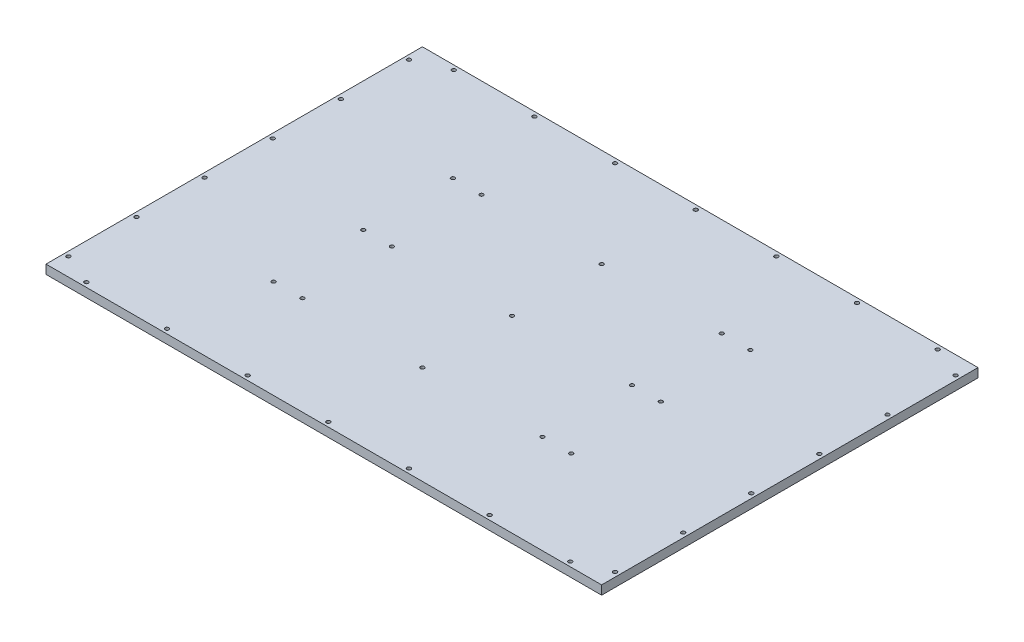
ISO-10303-21;
HEADER;
FILE_DESCRIPTION(('STEP AP214'),'2;1');
FILE_NAME('part.step','',(''),(''),'','','');
FILE_SCHEMA(('AUTOMOTIVE_DESIGN { 1 0 10303 214 1 1 1 1 }'));
ENDSEC;
DATA;
#1=APPLICATION_CONTEXT('core data for automotive mechanical design processes');
#2=APPLICATION_PROTOCOL_DEFINITION('international standard','automotive_design',2000,#1);
#3=PRODUCT_CONTEXT('',#1,'mechanical');
#4=PRODUCT('Part','Part','',(#3));
#5=PRODUCT_RELATED_PRODUCT_CATEGORY('part','',(#4));
#6=PRODUCT_DEFINITION_FORMATION('','',#4);
#7=PRODUCT_DEFINITION_CONTEXT('part definition',#1,'design');
#8=PRODUCT_DEFINITION('design','',#6,#7);
#9=PRODUCT_DEFINITION_SHAPE('','',#8);
#10=(LENGTH_UNIT() NAMED_UNIT(*) SI_UNIT(.MILLI.,.METRE.));
#11=(NAMED_UNIT(*) PLANE_ANGLE_UNIT() SI_UNIT($,.RADIAN.));
#12=(NAMED_UNIT(*) SI_UNIT($,.STERADIAN.) SOLID_ANGLE_UNIT());
#13=UNCERTAINTY_MEASURE_WITH_UNIT(LENGTH_MEASURE(1.E-05),#10,'distance_accuracy_value','');
#14=(GEOMETRIC_REPRESENTATION_CONTEXT(3) GLOBAL_UNCERTAINTY_ASSIGNED_CONTEXT((#13)) GLOBAL_UNIT_ASSIGNED_CONTEXT((#10,
#11,#12)) REPRESENTATION_CONTEXT('',''));
#15=CARTESIAN_POINT('',(0.,0.,0.));
#16=DIRECTION('',(0.,0.,1.));
#17=DIRECTION('',(1.,0.,0.));
#18=AXIS2_PLACEMENT_3D('',#15,#16,#17);
#19=CARTESIAN_POINT('',(0.,10.,0.));
#20=DIRECTION('',(0.,-1.,0.));
#21=DIRECTION('',(0.,0.,-1.));
#22=AXIS2_PLACEMENT_3D('',#19,#20,#21);
#23=PLANE('',#22);
#24=CARTESIAN_POINT('',(166.,10.,-99.9999999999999));
#25=DIRECTION('',(0.,1.,0.));
#26=DIRECTION('',(0.,0.,1.));
#27=AXIS2_PLACEMENT_3D('',#24,#25,#26);
#28=CIRCLE('',#27,2.09999999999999);
#29=CARTESIAN_POINT('',(166.,10.,-97.8999999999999));
#30=VERTEX_POINT('',#29);
#31=EDGE_CURVE('E357',#30,#30,#28,.T.);
#32=ORIENTED_EDGE('',*,*,#31,.F.);
#33=EDGE_LOOP('',(#32));
#34=FACE_BOUND('',#33,.T.);
#35=CARTESIAN_POINT('',(166.,10.,0.));
#36=DIRECTION('',(0.,1.,0.));
#37=DIRECTION('',(0.,0.,1.));
#38=AXIS2_PLACEMENT_3D('',#35,#36,#37);
#39=CIRCLE('',#38,2.09999999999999);
#40=CARTESIAN_POINT('',(166.,10.,2.10000000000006));
#41=VERTEX_POINT('',#40);
#42=EDGE_CURVE('E351',#41,#41,#39,.T.);
#43=ORIENTED_EDGE('',*,*,#42,.F.);
#44=EDGE_LOOP('',(#43));
#45=FACE_BOUND('',#44,.T.);
#46=CARTESIAN_POINT('',(166.,10.,100.));
#47=DIRECTION('',(0.,1.,0.));
#48=DIRECTION('',(0.,0.,1.));
#49=AXIS2_PLACEMENT_3D('',#46,#47,#48);
#50=CIRCLE('',#49,2.09999999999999);
#51=CARTESIAN_POINT('',(166.,10.,102.1));
#52=VERTEX_POINT('',#51);
#53=EDGE_CURVE('E345',#52,#52,#50,.T.);
#54=ORIENTED_EDGE('',*,*,#53,.F.);
#55=EDGE_LOOP('',(#54));
#56=FACE_BOUND('',#55,.T.);
#57=CARTESIAN_POINT('',(134.,10.,100.));
#58=DIRECTION('',(0.,1.,0.));
#59=DIRECTION('',(0.,0.,1.));
#60=AXIS2_PLACEMENT_3D('',#57,#58,#59);
#61=CIRCLE('',#60,2.09999999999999);
#62=CARTESIAN_POINT('',(134.,10.,102.1));
#63=VERTEX_POINT('',#62);
#64=EDGE_CURVE('E339',#63,#63,#61,.T.);
#65=ORIENTED_EDGE('',*,*,#64,.F.);
#66=EDGE_LOOP('',(#65));
#67=FACE_BOUND('',#66,.T.);
#68=CARTESIAN_POINT('',(134.,10.,0.));
#69=DIRECTION('',(0.,1.,0.));
#70=DIRECTION('',(0.,0.,1.));
#71=AXIS2_PLACEMENT_3D('',#68,#69,#70);
#72=CIRCLE('',#71,2.09999999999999);
#73=CARTESIAN_POINT('',(134.,10.,2.10000000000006));
#74=VERTEX_POINT('',#73);
#75=EDGE_CURVE('E333',#74,#74,#72,.T.);
#76=ORIENTED_EDGE('',*,*,#75,.F.);
#77=EDGE_LOOP('',(#76));
#78=FACE_BOUND('',#77,.T.);
#79=CARTESIAN_POINT('',(134.,10.,-99.9999999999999));
#80=DIRECTION('',(0.,1.,0.));
#81=DIRECTION('',(0.,0.,1.));
#82=AXIS2_PLACEMENT_3D('',#79,#80,#81);
#83=CIRCLE('',#82,2.09999999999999);
#84=CARTESIAN_POINT('',(134.,10.,-97.8999999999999));
#85=VERTEX_POINT('',#84);
#86=EDGE_CURVE('E327',#85,#85,#83,.T.);
#87=ORIENTED_EDGE('',*,*,#86,.F.);
#88=EDGE_LOOP('',(#87));
#89=FACE_BOUND('',#88,.T.);
#90=CARTESIAN_POINT('',(0.,10.,0.));
#91=DIRECTION('',(0.,1.,0.));
#92=DIRECTION('',(0.,0.,1.));
#93=AXIS2_PLACEMENT_3D('',#90,#91,#92);
#94=CIRCLE('',#93,2.09999999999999);
#95=CARTESIAN_POINT('',(0.,10.,2.10000000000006));
#96=VERTEX_POINT('',#95);
#97=EDGE_CURVE('E315',#96,#96,#94,.T.);
#98=ORIENTED_EDGE('',*,*,#97,.F.);
#99=EDGE_LOOP('',(#98));
#100=FACE_BOUND('',#99,.T.);
#101=CARTESIAN_POINT('',(0.,10.,100.));
#102=DIRECTION('',(0.,1.,0.));
#103=DIRECTION('',(0.,0.,1.));
#104=AXIS2_PLACEMENT_3D('',#101,#102,#103);
#105=CIRCLE('',#104,2.09999999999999);
#106=CARTESIAN_POINT('',(0.,10.,102.1));
#107=VERTEX_POINT('',#106);
#108=EDGE_CURVE('E309',#107,#107,#105,.T.);
#109=ORIENTED_EDGE('',*,*,#108,.F.);
#110=EDGE_LOOP('',(#109));
#111=FACE_BOUND('',#110,.T.);
#112=CARTESIAN_POINT('',(-134.,10.,0.));
#113=DIRECTION('',(0.,1.,0.));
#114=DIRECTION('',(0.,0.,1.));
#115=AXIS2_PLACEMENT_3D('',#112,#113,#114);
#116=CIRCLE('',#115,2.09999999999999);
#117=CARTESIAN_POINT('',(-134.,10.,2.10000000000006));
#118=VERTEX_POINT('',#117);
#119=EDGE_CURVE('E297',#118,#118,#116,.T.);
#120=ORIENTED_EDGE('',*,*,#119,.F.);
#121=EDGE_LOOP('',(#120));
#122=FACE_BOUND('',#121,.T.);
#123=CARTESIAN_POINT('',(-134.,10.,-99.9999999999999));
#124=DIRECTION('',(0.,1.,0.));
#125=DIRECTION('',(0.,0.,1.));
#126=AXIS2_PLACEMENT_3D('',#123,#124,#125);
#127=CIRCLE('',#126,2.09999999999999);
#128=CARTESIAN_POINT('',(-134.,10.,-97.8999999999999));
#129=VERTEX_POINT('',#128);
#130=EDGE_CURVE('E291',#129,#129,#127,.T.);
#131=ORIENTED_EDGE('',*,*,#130,.F.);
#132=EDGE_LOOP('',(#131));
#133=FACE_BOUND('',#132,.T.);
#134=CARTESIAN_POINT('',(-166.,10.,-99.9999999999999));
#135=DIRECTION('',(0.,1.,0.));
#136=DIRECTION('',(0.,0.,1.));
#137=AXIS2_PLACEMENT_3D('',#134,#135,#136);
#138=CIRCLE('',#137,2.09999999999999);
#139=CARTESIAN_POINT('',(-166.,10.,-97.8999999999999));
#140=VERTEX_POINT('',#139);
#141=EDGE_CURVE('E285',#140,#140,#138,.T.);
#142=ORIENTED_EDGE('',*,*,#141,.F.);
#143=EDGE_LOOP('',(#142));
#144=FACE_BOUND('',#143,.T.);
#145=CARTESIAN_POINT('',(-166.,10.,0.));
#146=DIRECTION('',(0.,1.,0.));
#147=DIRECTION('',(0.,0.,1.));
#148=AXIS2_PLACEMENT_3D('',#145,#146,#147);
#149=CIRCLE('',#148,2.09999999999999);
#150=CARTESIAN_POINT('',(-166.,10.,2.10000000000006));
#151=VERTEX_POINT('',#150);
#152=EDGE_CURVE('E279',#151,#151,#149,.T.);
#153=ORIENTED_EDGE('',*,*,#152,.F.);
#154=EDGE_LOOP('',(#153));
#155=FACE_BOUND('',#154,.T.);
#156=CARTESIAN_POINT('',(-166.,10.,100.));
#157=DIRECTION('',(0.,1.,0.));
#158=DIRECTION('',(0.,0.,1.));
#159=AXIS2_PLACEMENT_3D('',#156,#157,#158);
#160=CIRCLE('',#159,2.09999999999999);
#161=CARTESIAN_POINT('',(-166.,10.,102.1));
#162=VERTEX_POINT('',#161);
#163=EDGE_CURVE('E273',#162,#162,#160,.T.);
#164=ORIENTED_EDGE('',*,*,#163,.F.);
#165=EDGE_LOOP('',(#164));
#166=FACE_BOUND('',#165,.T.);
#167=CARTESIAN_POINT('',(305.,10.,189.999999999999));
#168=DIRECTION('',(0.,-1.,0.));
#169=DIRECTION('',(0.,0.,-1.));
#170=AXIS2_PLACEMENT_3D('',#167,#168,#169);
#171=CIRCLE('',#170,2.14999999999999);
#172=CARTESIAN_POINT('',(305.,10.,187.849999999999));
#173=VERTEX_POINT('',#172);
#174=EDGE_CURVE('E264',#173,#173,#171,.T.);
#175=ORIENTED_EDGE('',*,*,#174,.T.);
#176=EDGE_LOOP('',(#175));
#177=FACE_BOUND('',#176,.T.);
#178=CARTESIAN_POINT('',(305.,10.,113.999999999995));
#179=DIRECTION('',(0.,-1.,0.));
#180=DIRECTION('',(0.,0.,-1.));
#181=AXIS2_PLACEMENT_3D('',#178,#179,#180);
#182=CIRCLE('',#181,2.14999999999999);
#183=CARTESIAN_POINT('',(305.,10.,111.849999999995));
#184=VERTEX_POINT('',#183);
#185=EDGE_CURVE('E258',#184,#184,#182,.T.);
#186=ORIENTED_EDGE('',*,*,#185,.T.);
#187=EDGE_LOOP('',(#186));
#188=FACE_BOUND('',#187,.T.);
#189=CARTESIAN_POINT('',(305.,10.,37.999999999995));
#190=DIRECTION('',(0.,-1.,0.));
#191=DIRECTION('',(0.,0.,-1.));
#192=AXIS2_PLACEMENT_3D('',#189,#190,#191);
#193=CIRCLE('',#192,2.14999999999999);
#194=CARTESIAN_POINT('',(305.,10.,35.8499999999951));
#195=VERTEX_POINT('',#194);
#196=EDGE_CURVE('E252',#195,#195,#193,.T.);
#197=ORIENTED_EDGE('',*,*,#196,.T.);
#198=EDGE_LOOP('',(#197));
#199=FACE_BOUND('',#198,.T.);
#200=CARTESIAN_POINT('',(305.,10.,-38.0000000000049));
#201=DIRECTION('',(0.,-1.,0.));
#202=DIRECTION('',(0.,0.,-1.));
#203=AXIS2_PLACEMENT_3D('',#200,#201,#202);
#204=CIRCLE('',#203,2.14999999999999);
#205=CARTESIAN_POINT('',(305.,10.,-40.1500000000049));
#206=VERTEX_POINT('',#205);
#207=EDGE_CURVE('E246',#206,#206,#204,.T.);
#208=ORIENTED_EDGE('',*,*,#207,.T.);
#209=EDGE_LOOP('',(#208));
#210=FACE_BOUND('',#209,.T.);
#211=CARTESIAN_POINT('',(180.,10.,205.));
#212=DIRECTION('',(0.,-1.,0.));
#213=DIRECTION('',(0.,0.,-1.));
#214=AXIS2_PLACEMENT_3D('',#211,#212,#213);
#215=CIRCLE('',#214,2.14999999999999);
#216=CARTESIAN_POINT('',(180.,10.,202.85));
#217=VERTEX_POINT('',#216);
#218=EDGE_CURVE('E240',#217,#217,#215,.T.);
#219=ORIENTED_EDGE('',*,*,#218,.T.);
#220=EDGE_LOOP('',(#219));
#221=FACE_BOUND('',#220,.T.);
#222=CARTESIAN_POINT('',(89.9999999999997,10.,205.));
#223=DIRECTION('',(0.,-1.,0.));
#224=DIRECTION('',(0.,0.,-1.));
#225=AXIS2_PLACEMENT_3D('',#222,#223,#224);
#226=CIRCLE('',#225,2.15);
#227=CARTESIAN_POINT('',(89.9999999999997,10.,202.85));
#228=VERTEX_POINT('',#227);
#229=EDGE_CURVE('E234',#228,#228,#226,.T.);
#230=ORIENTED_EDGE('',*,*,#229,.T.);
#231=EDGE_LOOP('',(#230));
#232=FACE_BOUND('',#231,.T.);
#233=CARTESIAN_POINT('',(-2.99022959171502E-13,10.,205.));
#234=DIRECTION('',(0.,-1.,0.));
#235=DIRECTION('',(0.,0.,-1.));
#236=AXIS2_PLACEMENT_3D('',#233,#234,#235);
#237=CIRCLE('',#236,2.15);
#238=CARTESIAN_POINT('',(-2.99022959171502E-13,10.,202.85));
#239=VERTEX_POINT('',#238);
#240=EDGE_CURVE('E228',#239,#239,#237,.T.);
#241=ORIENTED_EDGE('',*,*,#240,.T.);
#242=EDGE_LOOP('',(#241));
#243=FACE_BOUND('',#242,.T.);
#244=CARTESIAN_POINT('',(-90.0000000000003,10.,205.));
#245=DIRECTION('',(0.,-1.,0.));
#246=DIRECTION('',(0.,0.,-1.));
#247=AXIS2_PLACEMENT_3D('',#244,#245,#246);
#248=CIRCLE('',#247,2.15);
#249=CARTESIAN_POINT('',(-90.0000000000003,10.,202.85));
#250=VERTEX_POINT('',#249);
#251=EDGE_CURVE('E222',#250,#250,#248,.T.);
#252=ORIENTED_EDGE('',*,*,#251,.T.);
#253=EDGE_LOOP('',(#252));
#254=FACE_BOUND('',#253,.T.);
#255=CARTESIAN_POINT('',(270.,10.,205.));
#256=DIRECTION('',(0.,-1.,0.));
#257=DIRECTION('',(0.,0.,-1.));
#258=AXIS2_PLACEMENT_3D('',#255,#256,#257);
#259=CIRCLE('',#258,2.14999999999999);
#260=CARTESIAN_POINT('',(270.,10.,202.85));
#261=VERTEX_POINT('',#260);
#262=EDGE_CURVE('E216',#261,#261,#259,.T.);
#263=ORIENTED_EDGE('',*,*,#262,.T.);
#264=EDGE_LOOP('',(#263));
#265=FACE_BOUND('',#264,.T.);
#266=CARTESIAN_POINT('',(-180.,10.,205.));
#267=DIRECTION('',(0.,-1.,0.));
#268=DIRECTION('',(0.,0.,-1.));
#269=AXIS2_PLACEMENT_3D('',#266,#267,#268);
#270=CIRCLE('',#269,2.14999999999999);
#271=CARTESIAN_POINT('',(-180.,10.,202.85));
#272=VERTEX_POINT('',#271);
#273=EDGE_CURVE('E210',#272,#272,#270,.T.);
#274=ORIENTED_EDGE('',*,*,#273,.T.);
#275=EDGE_LOOP('',(#274));
#276=FACE_BOUND('',#275,.T.);
#277=CARTESIAN_POINT('',(-270.,10.,205.));
#278=DIRECTION('',(0.,-1.,0.));
#279=DIRECTION('',(0.,0.,-1.));
#280=AXIS2_PLACEMENT_3D('',#277,#278,#279);
#281=CIRCLE('',#280,2.14999999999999);
#282=CARTESIAN_POINT('',(-270.,10.,202.85));
#283=VERTEX_POINT('',#282);
#284=EDGE_CURVE('E204',#283,#283,#281,.T.);
#285=ORIENTED_EDGE('',*,*,#284,.T.);
#286=EDGE_LOOP('',(#285));
#287=FACE_BOUND('',#286,.T.);
#288=CARTESIAN_POINT('',(-305.,10.,189.999999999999));
#289=DIRECTION('',(0.,-1.,0.));
#290=DIRECTION('',(0.,0.,-1.));
#291=AXIS2_PLACEMENT_3D('',#288,#289,#290);
#292=CIRCLE('',#291,2.14999999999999);
#293=CARTESIAN_POINT('',(-305.,10.,187.849999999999));
#294=VERTEX_POINT('',#293);
#295=EDGE_CURVE('E198',#294,#294,#292,.T.);
#296=ORIENTED_EDGE('',*,*,#295,.T.);
#297=EDGE_LOOP('',(#296));
#298=FACE_BOUND('',#297,.T.);
#299=CARTESIAN_POINT('',(-305.,10.,113.999999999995));
#300=DIRECTION('',(0.,-1.,0.));
#301=DIRECTION('',(0.,0.,-1.));
#302=AXIS2_PLACEMENT_3D('',#299,#300,#301);
#303=CIRCLE('',#302,2.14999999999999);
#304=CARTESIAN_POINT('',(-305.,10.,111.849999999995));
#305=VERTEX_POINT('',#304);
#306=EDGE_CURVE('E192',#305,#305,#303,.T.);
#307=ORIENTED_EDGE('',*,*,#306,.T.);
#308=EDGE_LOOP('',(#307));
#309=FACE_BOUND('',#308,.T.);
#310=CARTESIAN_POINT('',(-305.,10.,37.999999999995));
#311=DIRECTION('',(0.,-1.,0.));
#312=DIRECTION('',(0.,0.,-1.));
#313=AXIS2_PLACEMENT_3D('',#310,#311,#312);
#314=CIRCLE('',#313,2.14999999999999);
#315=CARTESIAN_POINT('',(-305.,10.,35.8499999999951));
#316=VERTEX_POINT('',#315);
#317=EDGE_CURVE('E186',#316,#316,#314,.T.);
#318=ORIENTED_EDGE('',*,*,#317,.T.);
#319=EDGE_LOOP('',(#318));
#320=FACE_BOUND('',#319,.T.);
#321=CARTESIAN_POINT('',(-305.,10.,-38.0000000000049));
#322=DIRECTION('',(0.,-1.,0.));
#323=DIRECTION('',(0.,0.,-1.));
#324=AXIS2_PLACEMENT_3D('',#321,#322,#323);
#325=CIRCLE('',#324,2.14999999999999);
#326=CARTESIAN_POINT('',(-305.,10.,-40.1500000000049));
#327=VERTEX_POINT('',#326);
#328=EDGE_CURVE('E180',#327,#327,#325,.T.);
#329=ORIENTED_EDGE('',*,*,#328,.T.);
#330=EDGE_LOOP('',(#329));
#331=FACE_BOUND('',#330,.T.);
#332=CARTESIAN_POINT('',(-305.,10.,-114.000000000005));
#333=DIRECTION('',(0.,-1.,0.));
#334=DIRECTION('',(0.,0.,-1.));
#335=AXIS2_PLACEMENT_3D('',#332,#333,#334);
#336=CIRCLE('',#335,2.14999999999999);
#337=CARTESIAN_POINT('',(-305.,10.,-116.150000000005));
#338=VERTEX_POINT('',#337);
#339=EDGE_CURVE('E174',#338,#338,#336,.T.);
#340=ORIENTED_EDGE('',*,*,#339,.T.);
#341=EDGE_LOOP('',(#340));
#342=FACE_BOUND('',#341,.T.);
#343=CARTESIAN_POINT('',(-305.,10.,-190.000000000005));
#344=DIRECTION('',(0.,-1.,0.));
#345=DIRECTION('',(0.,0.,-1.));
#346=AXIS2_PLACEMENT_3D('',#343,#344,#345);
#347=CIRCLE('',#346,2.14999999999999);
#348=CARTESIAN_POINT('',(-305.,10.,-192.150000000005));
#349=VERTEX_POINT('',#348);
#350=EDGE_CURVE('E168',#349,#349,#347,.T.);
#351=ORIENTED_EDGE('',*,*,#350,.T.);
#352=EDGE_LOOP('',(#351));
#353=FACE_BOUND('',#352,.T.);
#354=CARTESIAN_POINT('',(-270.,10.,-205.));
#355=DIRECTION('',(0.,-1.,0.));
#356=DIRECTION('',(0.,0.,-1.));
#357=AXIS2_PLACEMENT_3D('',#354,#355,#356);
#358=CIRCLE('',#357,2.14999999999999);
#359=CARTESIAN_POINT('',(-270.,10.,-207.15));
#360=VERTEX_POINT('',#359);
#361=EDGE_CURVE('E162',#360,#360,#358,.T.);
#362=ORIENTED_EDGE('',*,*,#361,.T.);
#363=EDGE_LOOP('',(#362));
#364=FACE_BOUND('',#363,.T.);
#365=CARTESIAN_POINT('',(-180.,10.,-205.));
#366=DIRECTION('',(0.,-1.,0.));
#367=DIRECTION('',(0.,0.,-1.));
#368=AXIS2_PLACEMENT_3D('',#365,#366,#367);
#369=CIRCLE('',#368,2.14999999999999);
#370=CARTESIAN_POINT('',(-180.,10.,-207.15));
#371=VERTEX_POINT('',#370);
#372=EDGE_CURVE('E156',#371,#371,#369,.T.);
#373=ORIENTED_EDGE('',*,*,#372,.T.);
#374=EDGE_LOOP('',(#373));
#375=FACE_BOUND('',#374,.T.);
#376=CARTESIAN_POINT('',(-90.0000000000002,10.,-205.));
#377=DIRECTION('',(0.,-1.,0.));
#378=DIRECTION('',(0.,0.,-1.));
#379=AXIS2_PLACEMENT_3D('',#376,#377,#378);
#380=CIRCLE('',#379,2.15);
#381=CARTESIAN_POINT('',(-90.0000000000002,10.,-207.15));
#382=VERTEX_POINT('',#381);
#383=EDGE_CURVE('E150',#382,#382,#380,.T.);
#384=ORIENTED_EDGE('',*,*,#383,.T.);
#385=EDGE_LOOP('',(#384));
#386=FACE_BOUND('',#385,.T.);
#387=CARTESIAN_POINT('',(-2.18575157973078E-13,10.,-205.));
#388=DIRECTION('',(0.,-1.,0.));
#389=DIRECTION('',(0.,0.,-1.));
#390=AXIS2_PLACEMENT_3D('',#387,#388,#389);
#391=CIRCLE('',#390,2.15);
#392=CARTESIAN_POINT('',(-2.18575157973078E-13,10.,-207.15));
#393=VERTEX_POINT('',#392);
#394=EDGE_CURVE('E144',#393,#393,#391,.T.);
#395=ORIENTED_EDGE('',*,*,#394,.T.);
#396=EDGE_LOOP('',(#395));
#397=FACE_BOUND('',#396,.T.);
#398=CARTESIAN_POINT('',(89.9999999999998,10.,-205.));
#399=DIRECTION('',(0.,-1.,0.));
#400=DIRECTION('',(0.,0.,-1.));
#401=AXIS2_PLACEMENT_3D('',#398,#399,#400);
#402=CIRCLE('',#401,2.15);
#403=CARTESIAN_POINT('',(89.9999999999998,10.,-207.15));
#404=VERTEX_POINT('',#403);
#405=EDGE_CURVE('E138',#404,#404,#402,.T.);
#406=ORIENTED_EDGE('',*,*,#405,.T.);
#407=EDGE_LOOP('',(#406));
#408=FACE_BOUND('',#407,.T.);
#409=CARTESIAN_POINT('',(180.,10.,-205.));
#410=DIRECTION('',(0.,-1.,0.));
#411=DIRECTION('',(0.,0.,-1.));
#412=AXIS2_PLACEMENT_3D('',#409,#410,#411);
#413=CIRCLE('',#412,2.14999999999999);
#414=CARTESIAN_POINT('',(180.,10.,-207.15));
#415=VERTEX_POINT('',#414);
#416=EDGE_CURVE('E132',#415,#415,#413,.T.);
#417=ORIENTED_EDGE('',*,*,#416,.T.);
#418=EDGE_LOOP('',(#417));
#419=FACE_BOUND('',#418,.T.);
#420=CARTESIAN_POINT('',(270.,10.,-205.));
#421=DIRECTION('',(0.,-1.,0.));
#422=DIRECTION('',(0.,0.,-1.));
#423=AXIS2_PLACEMENT_3D('',#420,#421,#422);
#424=CIRCLE('',#423,2.14999999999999);
#425=CARTESIAN_POINT('',(270.,10.,-207.15));
#426=VERTEX_POINT('',#425);
#427=EDGE_CURVE('E126',#426,#426,#424,.T.);
#428=ORIENTED_EDGE('',*,*,#427,.T.);
#429=EDGE_LOOP('',(#428));
#430=FACE_BOUND('',#429,.T.);
#431=CARTESIAN_POINT('',(305.,10.,-190.000000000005));
#432=DIRECTION('',(0.,-1.,0.));
#433=DIRECTION('',(0.,0.,-1.));
#434=AXIS2_PLACEMENT_3D('',#431,#432,#433);
#435=CIRCLE('',#434,2.14999999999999);
#436=CARTESIAN_POINT('',(305.,10.,-192.150000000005));
#437=VERTEX_POINT('',#436);
#438=EDGE_CURVE('E120',#437,#437,#435,.T.);
#439=ORIENTED_EDGE('',*,*,#438,.T.);
#440=EDGE_LOOP('',(#439));
#441=FACE_BOUND('',#440,.T.);
#442=CARTESIAN_POINT('',(305.,10.,-114.000000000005));
#443=DIRECTION('',(0.,-1.,0.));
#444=DIRECTION('',(0.,0.,-1.));
#445=AXIS2_PLACEMENT_3D('',#442,#443,#444);
#446=CIRCLE('',#445,2.14999999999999);
#447=CARTESIAN_POINT('',(305.,10.,-116.150000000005));
#448=VERTEX_POINT('',#447);
#449=EDGE_CURVE('E104',#448,#448,#446,.T.);
#450=ORIENTED_EDGE('',*,*,#449,.T.);
#451=EDGE_LOOP('',(#450));
#452=FACE_BOUND('',#451,.T.);
#453=DIRECTION('',(0.,0.,1.));
#454=VECTOR('',#453,1.);
#455=CARTESIAN_POINT('',(-310.,10.,-210.));
#456=LINE('',#455,#454);
#457=CARTESIAN_POINT('',(-310.,10.,-210.));
#458=VERTEX_POINT('',#457);
#459=CARTESIAN_POINT('',(-310.,10.,210.));
#460=VERTEX_POINT('',#459);
#461=EDGE_CURVE('E89',#458,#460,#456,.T.);
#462=ORIENTED_EDGE('',*,*,#461,.T.);
#463=DIRECTION('',(1.,0.,0.));
#464=VECTOR('',#463,1.);
#465=CARTESIAN_POINT('',(310.,10.,210.));
#466=LINE('',#465,#464);
#467=CARTESIAN_POINT('',(310.,10.,210.));
#468=VERTEX_POINT('',#467);
#469=EDGE_CURVE('E84',#460,#468,#466,.T.);
#470=ORIENTED_EDGE('',*,*,#469,.T.);
#471=DIRECTION('',(0.,0.,-1.));
#472=VECTOR('',#471,1.);
#473=CARTESIAN_POINT('',(310.,10.,-210.));
#474=LINE('',#473,#472);
#475=CARTESIAN_POINT('',(310.,10.,-210.));
#476=VERTEX_POINT('',#475);
#477=EDGE_CURVE('E87',#468,#476,#474,.T.);
#478=ORIENTED_EDGE('',*,*,#477,.T.);
#479=DIRECTION('',(-1.,0.,0.));
#480=VECTOR('',#479,1.);
#481=CARTESIAN_POINT('',(310.,10.,-210.));
#482=LINE('',#481,#480);
#483=EDGE_CURVE('E54',#476,#458,#482,.T.);
#484=ORIENTED_EDGE('',*,*,#483,.T.);
#485=EDGE_LOOP('',(#462,#470,#478,#484));
#486=FACE_BOUND('',#485,.T.);
#487=CARTESIAN_POINT('',(-134.,10.,100.));
#488=DIRECTION('',(0.,1.,0.));
#489=DIRECTION('',(0.,0.,1.));
#490=AXIS2_PLACEMENT_3D('',#487,#488,#489);
#491=CIRCLE('',#490,2.09999999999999);
#492=CARTESIAN_POINT('',(-134.,10.,102.1));
#493=VERTEX_POINT('',#492);
#494=EDGE_CURVE('E303',#493,#493,#491,.T.);
#495=ORIENTED_EDGE('',*,*,#494,.F.);
#496=EDGE_LOOP('',(#495));
#497=FACE_BOUND('',#496,.T.);
#498=CARTESIAN_POINT('',(0.,10.,-99.9999999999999));
#499=DIRECTION('',(0.,1.,0.));
#500=DIRECTION('',(0.,0.,1.));
#501=AXIS2_PLACEMENT_3D('',#498,#499,#500);
#502=CIRCLE('',#501,2.09999999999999);
#503=CARTESIAN_POINT('',(0.,10.,-97.8999999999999));
#504=VERTEX_POINT('',#503);
#505=EDGE_CURVE('E321',#504,#504,#502,.T.);
#506=ORIENTED_EDGE('',*,*,#505,.F.);
#507=EDGE_LOOP('',(#506));
#508=FACE_BOUND('',#507,.T.);
#509=ADVANCED_FACE('F37',(#34,#45,#56,#67,#78,#89,#100,#111,#122,#133,#144,#155,#166,#177,#188,
#199,#210,#221,#232,#243,#254,#265,#276,#287,#298,#309,#320,#331,#342,#353,#364,#375,#386,#397,
#408,#419,#430,#441,#452,#486,#497,#508),#23,.F.);
#510=CARTESIAN_POINT('',(-310.,10.,-210.));
#511=DIRECTION('',(1.,0.,0.));
#512=DIRECTION('',(0.,0.,-1.));
#513=AXIS2_PLACEMENT_3D('',#510,#511,#512);
#514=PLANE('',#513);
#515=DIRECTION('',(0.,0.,1.));
#516=VECTOR('',#515,1.);
#517=CARTESIAN_POINT('',(-310.,0.,-210.));
#518=LINE('',#517,#516);
#519=CARTESIAN_POINT('',(-310.,0.,-210.));
#520=VERTEX_POINT('',#519);
#521=CARTESIAN_POINT('',(-310.,0.,210.));
#522=VERTEX_POINT('',#521);
#523=EDGE_CURVE('E101',#520,#522,#518,.T.);
#524=ORIENTED_EDGE('',*,*,#523,.T.);
#525=DIRECTION('',(0.,-1.,0.));
#526=VECTOR('',#525,1.);
#527=CARTESIAN_POINT('',(-310.,10.,210.));
#528=LINE('',#527,#526);
#529=EDGE_CURVE('E11',#460,#522,#528,.T.);
#530=ORIENTED_EDGE('',*,*,#529,.F.);
#531=ORIENTED_EDGE('',*,*,#461,.F.);
#532=DIRECTION('',(0.,-1.,0.));
#533=VECTOR('',#532,1.);
#534=CARTESIAN_POINT('',(-310.,10.,-210.));
#535=LINE('',#534,#533);
#536=EDGE_CURVE('E97',#458,#520,#535,.T.);
#537=ORIENTED_EDGE('',*,*,#536,.T.);
#538=EDGE_LOOP('',(#524,#530,#531,#537));
#539=FACE_BOUND('',#538,.T.);
#540=ADVANCED_FACE('F39',(#539),#514,.F.);
#541=CARTESIAN_POINT('',(310.,10.,210.));
#542=DIRECTION('',(0.,0.,-1.));
#543=DIRECTION('',(-1.,0.,0.));
#544=AXIS2_PLACEMENT_3D('',#541,#542,#543);
#545=PLANE('',#544);
#546=DIRECTION('',(1.,0.,0.));
#547=VECTOR('',#546,1.);
#548=CARTESIAN_POINT('',(310.,0.,210.));
#549=LINE('',#548,#547);
#550=CARTESIAN_POINT('',(310.,0.,210.));
#551=VERTEX_POINT('',#550);
#552=EDGE_CURVE('E93',#522,#551,#549,.T.);
#553=ORIENTED_EDGE('',*,*,#552,.T.);
#554=DIRECTION('',(0.,-1.,0.));
#555=VECTOR('',#554,1.);
#556=CARTESIAN_POINT('',(310.,10.,210.));
#557=LINE('',#556,#555);
#558=EDGE_CURVE('E46',#468,#551,#557,.T.);
#559=ORIENTED_EDGE('',*,*,#558,.F.);
#560=ORIENTED_EDGE('',*,*,#469,.F.);
#561=ORIENTED_EDGE('',*,*,#529,.T.);
#562=EDGE_LOOP('',(#553,#559,#560,#561));
#563=FACE_BOUND('',#562,.T.);
#564=ADVANCED_FACE('F92',(#563),#545,.F.);
#565=CARTESIAN_POINT('',(310.,10.,-210.));
#566=DIRECTION('',(-1.,0.,0.));
#567=DIRECTION('',(0.,0.,1.));
#568=AXIS2_PLACEMENT_3D('',#565,#566,#567);
#569=PLANE('',#568);
#570=DIRECTION('',(0.,0.,-1.));
#571=VECTOR('',#570,1.);
#572=CARTESIAN_POINT('',(310.,0.,-210.));
#573=LINE('',#572,#571);
#574=CARTESIAN_POINT('',(310.,0.,-210.));
#575=VERTEX_POINT('',#574);
#576=EDGE_CURVE('E71',#551,#575,#573,.T.);
#577=ORIENTED_EDGE('',*,*,#576,.T.);
#578=DIRECTION('',(0.,-1.,0.));
#579=VECTOR('',#578,1.);
#580=CARTESIAN_POINT('',(310.,10.,-210.));
#581=LINE('',#580,#579);
#582=EDGE_CURVE('E94',#476,#575,#581,.T.);
#583=ORIENTED_EDGE('',*,*,#582,.F.);
#584=ORIENTED_EDGE('',*,*,#477,.F.);
#585=ORIENTED_EDGE('',*,*,#558,.T.);
#586=EDGE_LOOP('',(#577,#583,#584,#585));
#587=FACE_BOUND('',#586,.T.);
#588=ADVANCED_FACE('F95',(#587),#569,.F.);
#589=CARTESIAN_POINT('',(310.,10.,-210.));
#590=DIRECTION('',(0.,0.,1.));
#591=DIRECTION('',(1.,0.,0.));
#592=AXIS2_PLACEMENT_3D('',#589,#590,#591);
#593=PLANE('',#592);
#594=DIRECTION('',(-1.,0.,0.));
#595=VECTOR('',#594,1.);
#596=CARTESIAN_POINT('',(310.,0.,-210.));
#597=LINE('',#596,#595);
#598=EDGE_CURVE('E77',#575,#520,#597,.T.);
#599=ORIENTED_EDGE('',*,*,#598,.T.);
#600=ORIENTED_EDGE('',*,*,#536,.F.);
#601=ORIENTED_EDGE('',*,*,#483,.F.);
#602=ORIENTED_EDGE('',*,*,#582,.T.);
#603=EDGE_LOOP('',(#599,#600,#601,#602));
#604=FACE_BOUND('',#603,.T.);
#605=ADVANCED_FACE('F109',(#604),#593,.F.);
#606=CARTESIAN_POINT('',(0.,0.,0.));
#607=DIRECTION('',(0.,-1.,0.));
#608=DIRECTION('',(0.,0.,-1.));
#609=AXIS2_PLACEMENT_3D('',#606,#607,#608);
#610=PLANE('',#609);
#611=CARTESIAN_POINT('',(166.,0.,-99.9999999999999));
#612=DIRECTION('',(0.,1.,0.));
#613=DIRECTION('',(0.,0.,1.));
#614=AXIS2_PLACEMENT_3D('',#611,#612,#613);
#615=CIRCLE('',#614,2.09999999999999);
#616=CARTESIAN_POINT('',(166.,0.,-97.8999999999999));
#617=VERTEX_POINT('',#616);
#618=EDGE_CURVE('E354',#617,#617,#615,.T.);
#619=ORIENTED_EDGE('',*,*,#618,.T.);
#620=EDGE_LOOP('',(#619));
#621=FACE_BOUND('',#620,.T.);
#622=CARTESIAN_POINT('',(166.,0.,0.));
#623=DIRECTION('',(0.,1.,0.));
#624=DIRECTION('',(0.,0.,1.));
#625=AXIS2_PLACEMENT_3D('',#622,#623,#624);
#626=CIRCLE('',#625,2.09999999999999);
#627=CARTESIAN_POINT('',(166.,0.,2.10000000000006));
#628=VERTEX_POINT('',#627);
#629=EDGE_CURVE('E348',#628,#628,#626,.T.);
#630=ORIENTED_EDGE('',*,*,#629,.T.);
#631=EDGE_LOOP('',(#630));
#632=FACE_BOUND('',#631,.T.);
#633=CARTESIAN_POINT('',(166.,0.,100.));
#634=DIRECTION('',(0.,1.,0.));
#635=DIRECTION('',(0.,0.,1.));
#636=AXIS2_PLACEMENT_3D('',#633,#634,#635);
#637=CIRCLE('',#636,2.09999999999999);
#638=CARTESIAN_POINT('',(166.,0.,102.1));
#639=VERTEX_POINT('',#638);
#640=EDGE_CURVE('E342',#639,#639,#637,.T.);
#641=ORIENTED_EDGE('',*,*,#640,.T.);
#642=EDGE_LOOP('',(#641));
#643=FACE_BOUND('',#642,.T.);
#644=CARTESIAN_POINT('',(134.,0.,100.));
#645=DIRECTION('',(0.,1.,0.));
#646=DIRECTION('',(0.,0.,1.));
#647=AXIS2_PLACEMENT_3D('',#644,#645,#646);
#648=CIRCLE('',#647,2.09999999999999);
#649=CARTESIAN_POINT('',(134.,0.,102.1));
#650=VERTEX_POINT('',#649);
#651=EDGE_CURVE('E336',#650,#650,#648,.T.);
#652=ORIENTED_EDGE('',*,*,#651,.T.);
#653=EDGE_LOOP('',(#652));
#654=FACE_BOUND('',#653,.T.);
#655=CARTESIAN_POINT('',(134.,0.,0.));
#656=DIRECTION('',(0.,1.,0.));
#657=DIRECTION('',(0.,0.,1.));
#658=AXIS2_PLACEMENT_3D('',#655,#656,#657);
#659=CIRCLE('',#658,2.09999999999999);
#660=CARTESIAN_POINT('',(134.,0.,2.10000000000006));
#661=VERTEX_POINT('',#660);
#662=EDGE_CURVE('E330',#661,#661,#659,.T.);
#663=ORIENTED_EDGE('',*,*,#662,.T.);
#664=EDGE_LOOP('',(#663));
#665=FACE_BOUND('',#664,.T.);
#666=CARTESIAN_POINT('',(134.,0.,-99.9999999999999));
#667=DIRECTION('',(0.,1.,0.));
#668=DIRECTION('',(0.,0.,1.));
#669=AXIS2_PLACEMENT_3D('',#666,#667,#668);
#670=CIRCLE('',#669,2.09999999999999);
#671=CARTESIAN_POINT('',(134.,0.,-97.8999999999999));
#672=VERTEX_POINT('',#671);
#673=EDGE_CURVE('E324',#672,#672,#670,.T.);
#674=ORIENTED_EDGE('',*,*,#673,.T.);
#675=EDGE_LOOP('',(#674));
#676=FACE_BOUND('',#675,.T.);
#677=CARTESIAN_POINT('',(0.,0.,-99.9999999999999));
#678=DIRECTION('',(0.,1.,0.));
#679=DIRECTION('',(0.,0.,1.));
#680=AXIS2_PLACEMENT_3D('',#677,#678,#679);
#681=CIRCLE('',#680,2.1);
#682=CARTESIAN_POINT('',(0.,0.,-97.8999999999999));
#683=VERTEX_POINT('',#682);
#684=EDGE_CURVE('E318',#683,#683,#681,.T.);
#685=ORIENTED_EDGE('',*,*,#684,.T.);
#686=EDGE_LOOP('',(#685));
#687=FACE_BOUND('',#686,.T.);
#688=CARTESIAN_POINT('',(0.,0.,0.));
#689=DIRECTION('',(0.,1.,0.));
#690=DIRECTION('',(0.,0.,1.));
#691=AXIS2_PLACEMENT_3D('',#688,#689,#690);
#692=CIRCLE('',#691,2.1);
#693=CARTESIAN_POINT('',(0.,0.,2.10000000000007));
#694=VERTEX_POINT('',#693);
#695=EDGE_CURVE('E312',#694,#694,#692,.T.);
#696=ORIENTED_EDGE('',*,*,#695,.T.);
#697=EDGE_LOOP('',(#696));
#698=FACE_BOUND('',#697,.T.);
#699=CARTESIAN_POINT('',(0.,0.,100.));
#700=DIRECTION('',(0.,1.,0.));
#701=DIRECTION('',(0.,0.,1.));
#702=AXIS2_PLACEMENT_3D('',#699,#700,#701);
#703=CIRCLE('',#702,2.1);
#704=CARTESIAN_POINT('',(0.,0.,102.1));
#705=VERTEX_POINT('',#704);
#706=EDGE_CURVE('E306',#705,#705,#703,.T.);
#707=ORIENTED_EDGE('',*,*,#706,.T.);
#708=EDGE_LOOP('',(#707));
#709=FACE_BOUND('',#708,.T.);
#710=CARTESIAN_POINT('',(-134.,0.,100.));
#711=DIRECTION('',(0.,1.,0.));
#712=DIRECTION('',(0.,0.,1.));
#713=AXIS2_PLACEMENT_3D('',#710,#711,#712);
#714=CIRCLE('',#713,2.09999999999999);
#715=CARTESIAN_POINT('',(-134.,0.,102.1));
#716=VERTEX_POINT('',#715);
#717=EDGE_CURVE('E300',#716,#716,#714,.T.);
#718=ORIENTED_EDGE('',*,*,#717,.T.);
#719=EDGE_LOOP('',(#718));
#720=FACE_BOUND('',#719,.T.);
#721=CARTESIAN_POINT('',(-134.,0.,0.));
#722=DIRECTION('',(0.,1.,0.));
#723=DIRECTION('',(0.,0.,1.));
#724=AXIS2_PLACEMENT_3D('',#721,#722,#723);
#725=CIRCLE('',#724,2.09999999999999);
#726=CARTESIAN_POINT('',(-134.,0.,2.10000000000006));
#727=VERTEX_POINT('',#726);
#728=EDGE_CURVE('E294',#727,#727,#725,.T.);
#729=ORIENTED_EDGE('',*,*,#728,.T.);
#730=EDGE_LOOP('',(#729));
#731=FACE_BOUND('',#730,.T.);
#732=CARTESIAN_POINT('',(-134.,0.,-99.9999999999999));
#733=DIRECTION('',(0.,1.,0.));
#734=DIRECTION('',(0.,0.,1.));
#735=AXIS2_PLACEMENT_3D('',#732,#733,#734);
#736=CIRCLE('',#735,2.09999999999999);
#737=CARTESIAN_POINT('',(-134.,0.,-97.8999999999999));
#738=VERTEX_POINT('',#737);
#739=EDGE_CURVE('E288',#738,#738,#736,.T.);
#740=ORIENTED_EDGE('',*,*,#739,.T.);
#741=EDGE_LOOP('',(#740));
#742=FACE_BOUND('',#741,.T.);
#743=CARTESIAN_POINT('',(-166.,0.,-99.9999999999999));
#744=DIRECTION('',(0.,1.,0.));
#745=DIRECTION('',(0.,0.,1.));
#746=AXIS2_PLACEMENT_3D('',#743,#744,#745);
#747=CIRCLE('',#746,2.09999999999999);
#748=CARTESIAN_POINT('',(-166.,0.,-97.8999999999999));
#749=VERTEX_POINT('',#748);
#750=EDGE_CURVE('E282',#749,#749,#747,.T.);
#751=ORIENTED_EDGE('',*,*,#750,.T.);
#752=EDGE_LOOP('',(#751));
#753=FACE_BOUND('',#752,.T.);
#754=CARTESIAN_POINT('',(-166.,0.,0.));
#755=DIRECTION('',(0.,1.,0.));
#756=DIRECTION('',(0.,0.,1.));
#757=AXIS2_PLACEMENT_3D('',#754,#755,#756);
#758=CIRCLE('',#757,2.09999999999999);
#759=CARTESIAN_POINT('',(-166.,0.,2.10000000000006));
#760=VERTEX_POINT('',#759);
#761=EDGE_CURVE('E276',#760,#760,#758,.T.);
#762=ORIENTED_EDGE('',*,*,#761,.T.);
#763=EDGE_LOOP('',(#762));
#764=FACE_BOUND('',#763,.T.);
#765=CARTESIAN_POINT('',(-166.,0.,100.));
#766=DIRECTION('',(0.,1.,0.));
#767=DIRECTION('',(0.,0.,1.));
#768=AXIS2_PLACEMENT_3D('',#765,#766,#767);
#769=CIRCLE('',#768,2.09999999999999);
#770=CARTESIAN_POINT('',(-166.,0.,102.1));
#771=VERTEX_POINT('',#770);
#772=EDGE_CURVE('E270',#771,#771,#769,.T.);
#773=ORIENTED_EDGE('',*,*,#772,.T.);
#774=EDGE_LOOP('',(#773));
#775=FACE_BOUND('',#774,.T.);
#776=CARTESIAN_POINT('',(305.,0.,189.999999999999));
#777=DIRECTION('',(0.,-1.,0.));
#778=DIRECTION('',(0.,0.,-1.));
#779=AXIS2_PLACEMENT_3D('',#776,#777,#778);
#780=CIRCLE('',#779,2.14999999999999);
#781=CARTESIAN_POINT('',(305.,0.,187.849999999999));
#782=VERTEX_POINT('',#781);
#783=EDGE_CURVE('E267',#782,#782,#780,.T.);
#784=ORIENTED_EDGE('',*,*,#783,.F.);
#785=EDGE_LOOP('',(#784));
#786=FACE_BOUND('',#785,.T.);
#787=CARTESIAN_POINT('',(305.,0.,113.999999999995));
#788=DIRECTION('',(0.,-1.,0.));
#789=DIRECTION('',(0.,0.,-1.));
#790=AXIS2_PLACEMENT_3D('',#787,#788,#789);
#791=CIRCLE('',#790,2.14999999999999);
#792=CARTESIAN_POINT('',(305.,0.,111.849999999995));
#793=VERTEX_POINT('',#792);
#794=EDGE_CURVE('E261',#793,#793,#791,.T.);
#795=ORIENTED_EDGE('',*,*,#794,.F.);
#796=EDGE_LOOP('',(#795));
#797=FACE_BOUND('',#796,.T.);
#798=CARTESIAN_POINT('',(305.,0.,37.999999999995));
#799=DIRECTION('',(0.,-1.,0.));
#800=DIRECTION('',(0.,0.,-1.));
#801=AXIS2_PLACEMENT_3D('',#798,#799,#800);
#802=CIRCLE('',#801,2.14999999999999);
#803=CARTESIAN_POINT('',(305.,0.,35.8499999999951));
#804=VERTEX_POINT('',#803);
#805=EDGE_CURVE('E255',#804,#804,#802,.T.);
#806=ORIENTED_EDGE('',*,*,#805,.F.);
#807=EDGE_LOOP('',(#806));
#808=FACE_BOUND('',#807,.T.);
#809=CARTESIAN_POINT('',(305.,0.,-38.0000000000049));
#810=DIRECTION('',(0.,-1.,0.));
#811=DIRECTION('',(0.,0.,-1.));
#812=AXIS2_PLACEMENT_3D('',#809,#810,#811);
#813=CIRCLE('',#812,2.14999999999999);
#814=CARTESIAN_POINT('',(305.,0.,-40.1500000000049));
#815=VERTEX_POINT('',#814);
#816=EDGE_CURVE('E249',#815,#815,#813,.T.);
#817=ORIENTED_EDGE('',*,*,#816,.F.);
#818=EDGE_LOOP('',(#817));
#819=FACE_BOUND('',#818,.T.);
#820=CARTESIAN_POINT('',(180.,0.,205.));
#821=DIRECTION('',(0.,-1.,0.));
#822=DIRECTION('',(0.,0.,-1.));
#823=AXIS2_PLACEMENT_3D('',#820,#821,#822);
#824=CIRCLE('',#823,2.14999999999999);
#825=CARTESIAN_POINT('',(180.,0.,202.85));
#826=VERTEX_POINT('',#825);
#827=EDGE_CURVE('E243',#826,#826,#824,.T.);
#828=ORIENTED_EDGE('',*,*,#827,.F.);
#829=EDGE_LOOP('',(#828));
#830=FACE_BOUND('',#829,.T.);
#831=CARTESIAN_POINT('',(89.9999999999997,0.,205.));
#832=DIRECTION('',(0.,-1.,0.));
#833=DIRECTION('',(0.,0.,-1.));
#834=AXIS2_PLACEMENT_3D('',#831,#832,#833);
#835=CIRCLE('',#834,2.15);
#836=CARTESIAN_POINT('',(89.9999999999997,0.,202.85));
#837=VERTEX_POINT('',#836);
#838=EDGE_CURVE('E237',#837,#837,#835,.T.);
#839=ORIENTED_EDGE('',*,*,#838,.F.);
#840=EDGE_LOOP('',(#839));
#841=FACE_BOUND('',#840,.T.);
#842=CARTESIAN_POINT('',(-2.99022959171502E-13,0.,205.));
#843=DIRECTION('',(0.,-1.,0.));
#844=DIRECTION('',(0.,0.,-1.));
#845=AXIS2_PLACEMENT_3D('',#842,#843,#844);
#846=CIRCLE('',#845,2.15);
#847=CARTESIAN_POINT('',(-2.99022959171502E-13,0.,202.85));
#848=VERTEX_POINT('',#847);
#849=EDGE_CURVE('E231',#848,#848,#846,.T.);
#850=ORIENTED_EDGE('',*,*,#849,.F.);
#851=EDGE_LOOP('',(#850));
#852=FACE_BOUND('',#851,.T.);
#853=CARTESIAN_POINT('',(-90.0000000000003,0.,205.));
#854=DIRECTION('',(0.,-1.,0.));
#855=DIRECTION('',(0.,0.,-1.));
#856=AXIS2_PLACEMENT_3D('',#853,#854,#855);
#857=CIRCLE('',#856,2.15);
#858=CARTESIAN_POINT('',(-90.0000000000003,0.,202.85));
#859=VERTEX_POINT('',#858);
#860=EDGE_CURVE('E225',#859,#859,#857,.T.);
#861=ORIENTED_EDGE('',*,*,#860,.F.);
#862=EDGE_LOOP('',(#861));
#863=FACE_BOUND('',#862,.T.);
#864=CARTESIAN_POINT('',(270.,0.,205.));
#865=DIRECTION('',(0.,-1.,0.));
#866=DIRECTION('',(0.,0.,-1.));
#867=AXIS2_PLACEMENT_3D('',#864,#865,#866);
#868=CIRCLE('',#867,2.14999999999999);
#869=CARTESIAN_POINT('',(270.,0.,202.85));
#870=VERTEX_POINT('',#869);
#871=EDGE_CURVE('E219',#870,#870,#868,.T.);
#872=ORIENTED_EDGE('',*,*,#871,.F.);
#873=EDGE_LOOP('',(#872));
#874=FACE_BOUND('',#873,.T.);
#875=CARTESIAN_POINT('',(-180.,0.,205.));
#876=DIRECTION('',(0.,-1.,0.));
#877=DIRECTION('',(0.,0.,-1.));
#878=AXIS2_PLACEMENT_3D('',#875,#876,#877);
#879=CIRCLE('',#878,2.14999999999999);
#880=CARTESIAN_POINT('',(-180.,0.,202.85));
#881=VERTEX_POINT('',#880);
#882=EDGE_CURVE('E213',#881,#881,#879,.T.);
#883=ORIENTED_EDGE('',*,*,#882,.F.);
#884=EDGE_LOOP('',(#883));
#885=FACE_BOUND('',#884,.T.);
#886=CARTESIAN_POINT('',(-270.,0.,205.));
#887=DIRECTION('',(0.,-1.,0.));
#888=DIRECTION('',(0.,0.,-1.));
#889=AXIS2_PLACEMENT_3D('',#886,#887,#888);
#890=CIRCLE('',#889,2.14999999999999);
#891=CARTESIAN_POINT('',(-270.,0.,202.85));
#892=VERTEX_POINT('',#891);
#893=EDGE_CURVE('E207',#892,#892,#890,.T.);
#894=ORIENTED_EDGE('',*,*,#893,.F.);
#895=EDGE_LOOP('',(#894));
#896=FACE_BOUND('',#895,.T.);
#897=CARTESIAN_POINT('',(-305.,0.,189.999999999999));
#898=DIRECTION('',(0.,-1.,0.));
#899=DIRECTION('',(0.,0.,-1.));
#900=AXIS2_PLACEMENT_3D('',#897,#898,#899);
#901=CIRCLE('',#900,2.14999999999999);
#902=CARTESIAN_POINT('',(-305.,0.,187.849999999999));
#903=VERTEX_POINT('',#902);
#904=EDGE_CURVE('E201',#903,#903,#901,.T.);
#905=ORIENTED_EDGE('',*,*,#904,.F.);
#906=EDGE_LOOP('',(#905));
#907=FACE_BOUND('',#906,.T.);
#908=CARTESIAN_POINT('',(-305.,0.,113.999999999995));
#909=DIRECTION('',(0.,-1.,0.));
#910=DIRECTION('',(0.,0.,-1.));
#911=AXIS2_PLACEMENT_3D('',#908,#909,#910);
#912=CIRCLE('',#911,2.14999999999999);
#913=CARTESIAN_POINT('',(-305.,0.,111.849999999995));
#914=VERTEX_POINT('',#913);
#915=EDGE_CURVE('E195',#914,#914,#912,.T.);
#916=ORIENTED_EDGE('',*,*,#915,.F.);
#917=EDGE_LOOP('',(#916));
#918=FACE_BOUND('',#917,.T.);
#919=CARTESIAN_POINT('',(-305.,0.,37.999999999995));
#920=DIRECTION('',(0.,-1.,0.));
#921=DIRECTION('',(0.,0.,-1.));
#922=AXIS2_PLACEMENT_3D('',#919,#920,#921);
#923=CIRCLE('',#922,2.14999999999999);
#924=CARTESIAN_POINT('',(-305.,0.,35.8499999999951));
#925=VERTEX_POINT('',#924);
#926=EDGE_CURVE('E189',#925,#925,#923,.T.);
#927=ORIENTED_EDGE('',*,*,#926,.F.);
#928=EDGE_LOOP('',(#927));
#929=FACE_BOUND('',#928,.T.);
#930=CARTESIAN_POINT('',(-305.,0.,-38.0000000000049));
#931=DIRECTION('',(0.,-1.,0.));
#932=DIRECTION('',(0.,0.,-1.));
#933=AXIS2_PLACEMENT_3D('',#930,#931,#932);
#934=CIRCLE('',#933,2.14999999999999);
#935=CARTESIAN_POINT('',(-305.,0.,-40.1500000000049));
#936=VERTEX_POINT('',#935);
#937=EDGE_CURVE('E183',#936,#936,#934,.T.);
#938=ORIENTED_EDGE('',*,*,#937,.F.);
#939=EDGE_LOOP('',(#938));
#940=FACE_BOUND('',#939,.T.);
#941=CARTESIAN_POINT('',(-305.,0.,-114.000000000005));
#942=DIRECTION('',(0.,-1.,0.));
#943=DIRECTION('',(0.,0.,-1.));
#944=AXIS2_PLACEMENT_3D('',#941,#942,#943);
#945=CIRCLE('',#944,2.14999999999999);
#946=CARTESIAN_POINT('',(-305.,0.,-116.150000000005));
#947=VERTEX_POINT('',#946);
#948=EDGE_CURVE('E177',#947,#947,#945,.T.);
#949=ORIENTED_EDGE('',*,*,#948,.F.);
#950=EDGE_LOOP('',(#949));
#951=FACE_BOUND('',#950,.T.);
#952=CARTESIAN_POINT('',(-305.,0.,-190.000000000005));
#953=DIRECTION('',(0.,-1.,0.));
#954=DIRECTION('',(0.,0.,-1.));
#955=AXIS2_PLACEMENT_3D('',#952,#953,#954);
#956=CIRCLE('',#955,2.14999999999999);
#957=CARTESIAN_POINT('',(-305.,0.,-192.150000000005));
#958=VERTEX_POINT('',#957);
#959=EDGE_CURVE('E171',#958,#958,#956,.T.);
#960=ORIENTED_EDGE('',*,*,#959,.F.);
#961=EDGE_LOOP('',(#960));
#962=FACE_BOUND('',#961,.T.);
#963=CARTESIAN_POINT('',(-270.,0.,-205.));
#964=DIRECTION('',(0.,-1.,0.));
#965=DIRECTION('',(0.,0.,-1.));
#966=AXIS2_PLACEMENT_3D('',#963,#964,#965);
#967=CIRCLE('',#966,2.14999999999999);
#968=CARTESIAN_POINT('',(-270.,0.,-207.15));
#969=VERTEX_POINT('',#968);
#970=EDGE_CURVE('E165',#969,#969,#967,.T.);
#971=ORIENTED_EDGE('',*,*,#970,.F.);
#972=EDGE_LOOP('',(#971));
#973=FACE_BOUND('',#972,.T.);
#974=CARTESIAN_POINT('',(-180.,0.,-205.));
#975=DIRECTION('',(0.,-1.,0.));
#976=DIRECTION('',(0.,0.,-1.));
#977=AXIS2_PLACEMENT_3D('',#974,#975,#976);
#978=CIRCLE('',#977,2.15000000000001);
#979=CARTESIAN_POINT('',(-180.,0.,-207.15));
#980=VERTEX_POINT('',#979);
#981=EDGE_CURVE('E159',#980,#980,#978,.T.);
#982=ORIENTED_EDGE('',*,*,#981,.F.);
#983=EDGE_LOOP('',(#982));
#984=FACE_BOUND('',#983,.T.);
#985=CARTESIAN_POINT('',(-90.0000000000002,0.,-205.));
#986=DIRECTION('',(0.,-1.,0.));
#987=DIRECTION('',(0.,0.,-1.));
#988=AXIS2_PLACEMENT_3D('',#985,#986,#987);
#989=CIRCLE('',#988,2.15);
#990=CARTESIAN_POINT('',(-90.0000000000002,0.,-207.15));
#991=VERTEX_POINT('',#990);
#992=EDGE_CURVE('E153',#991,#991,#989,.T.);
#993=ORIENTED_EDGE('',*,*,#992,.F.);
#994=EDGE_LOOP('',(#993));
#995=FACE_BOUND('',#994,.T.);
#996=CARTESIAN_POINT('',(-2.18575157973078E-13,0.,-205.));
#997=DIRECTION('',(0.,-1.,0.));
#998=DIRECTION('',(0.,0.,-1.));
#999=AXIS2_PLACEMENT_3D('',#996,#997,#998);
#1000=CIRCLE('',#999,2.15);
#1001=CARTESIAN_POINT('',(-2.18575157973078E-13,0.,-207.15));
#1002=VERTEX_POINT('',#1001);
#1003=EDGE_CURVE('E147',#1002,#1002,#1000,.T.);
#1004=ORIENTED_EDGE('',*,*,#1003,.F.);
#1005=EDGE_LOOP('',(#1004));
#1006=FACE_BOUND('',#1005,.T.);
#1007=CARTESIAN_POINT('',(89.9999999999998,0.,-205.));
#1008=DIRECTION('',(0.,-1.,0.));
#1009=DIRECTION('',(0.,0.,-1.));
#1010=AXIS2_PLACEMENT_3D('',#1007,#1008,#1009);
#1011=CIRCLE('',#1010,2.15);
#1012=CARTESIAN_POINT('',(89.9999999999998,0.,-207.15));
#1013=VERTEX_POINT('',#1012);
#1014=EDGE_CURVE('E141',#1013,#1013,#1011,.T.);
#1015=ORIENTED_EDGE('',*,*,#1014,.F.);
#1016=EDGE_LOOP('',(#1015));
#1017=FACE_BOUND('',#1016,.T.);
#1018=CARTESIAN_POINT('',(180.,0.,-205.));
#1019=DIRECTION('',(0.,-1.,0.));
#1020=DIRECTION('',(0.,0.,-1.));
#1021=AXIS2_PLACEMENT_3D('',#1018,#1019,#1020);
#1022=CIRCLE('',#1021,2.15000000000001);
#1023=CARTESIAN_POINT('',(180.,0.,-207.15));
#1024=VERTEX_POINT('',#1023);
#1025=EDGE_CURVE('E135',#1024,#1024,#1022,.T.);
#1026=ORIENTED_EDGE('',*,*,#1025,.F.);
#1027=EDGE_LOOP('',(#1026));
#1028=FACE_BOUND('',#1027,.T.);
#1029=CARTESIAN_POINT('',(270.,0.,-205.));
#1030=DIRECTION('',(0.,-1.,0.));
#1031=DIRECTION('',(0.,0.,-1.));
#1032=AXIS2_PLACEMENT_3D('',#1029,#1030,#1031);
#1033=CIRCLE('',#1032,2.14999999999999);
#1034=CARTESIAN_POINT('',(270.,0.,-207.15));
#1035=VERTEX_POINT('',#1034);
#1036=EDGE_CURVE('E129',#1035,#1035,#1033,.T.);
#1037=ORIENTED_EDGE('',*,*,#1036,.F.);
#1038=EDGE_LOOP('',(#1037));
#1039=FACE_BOUND('',#1038,.T.);
#1040=CARTESIAN_POINT('',(305.,0.,-190.000000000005));
#1041=DIRECTION('',(0.,-1.,0.));
#1042=DIRECTION('',(0.,0.,-1.));
#1043=AXIS2_PLACEMENT_3D('',#1040,#1041,#1042);
#1044=CIRCLE('',#1043,2.14999999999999);
#1045=CARTESIAN_POINT('',(305.,0.,-192.150000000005));
#1046=VERTEX_POINT('',#1045);
#1047=EDGE_CURVE('E123',#1046,#1046,#1044,.T.);
#1048=ORIENTED_EDGE('',*,*,#1047,.F.);
#1049=EDGE_LOOP('',(#1048));
#1050=FACE_BOUND('',#1049,.T.);
#1051=CARTESIAN_POINT('',(305.,0.,-114.000000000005));
#1052=DIRECTION('',(0.,-1.,0.));
#1053=DIRECTION('',(0.,0.,-1.));
#1054=AXIS2_PLACEMENT_3D('',#1051,#1052,#1053);
#1055=CIRCLE('',#1054,2.14999999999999);
#1056=CARTESIAN_POINT('',(305.,0.,-116.150000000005));
#1057=VERTEX_POINT('',#1056);
#1058=EDGE_CURVE('E117',#1057,#1057,#1055,.T.);
#1059=ORIENTED_EDGE('',*,*,#1058,.F.);
#1060=EDGE_LOOP('',(#1059));
#1061=FACE_BOUND('',#1060,.T.);
#1062=ORIENTED_EDGE('',*,*,#523,.F.);
#1063=ORIENTED_EDGE('',*,*,#598,.F.);
#1064=ORIENTED_EDGE('',*,*,#576,.F.);
#1065=ORIENTED_EDGE('',*,*,#552,.F.);
#1066=EDGE_LOOP('',(#1062,#1063,#1064,#1065));
#1067=FACE_BOUND('',#1066,.T.);
#1068=ADVANCED_FACE('F112',(#621,#632,#643,#654,#665,#676,#687,#698,#709,#720,#731,#742,#753,
#764,#775,#786,#797,#808,#819,#830,#841,#852,#863,#874,#885,#896,#907,#918,#929,#940,#951,#962,
#973,#984,#995,#1006,#1017,#1028,#1039,#1050,#1061,#1067),#610,.T.);
#1069=CARTESIAN_POINT('',(305.,0.,-114.000000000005));
#1070=DIRECTION('',(0.,-1.,0.));
#1071=DIRECTION('',(0.,0.,-1.));
#1072=AXIS2_PLACEMENT_3D('',#1069,#1070,#1071);
#1073=CYLINDRICAL_SURFACE('',#1072,2.14999999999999);
#1074=ORIENTED_EDGE('',*,*,#449,.F.);
#1075=EDGE_LOOP('',(#1074));
#1076=FACE_BOUND('',#1075,.T.);
#1077=ORIENTED_EDGE('',*,*,#1058,.T.);
#1078=EDGE_LOOP('',(#1077));
#1079=FACE_BOUND('',#1078,.T.);
#1080=ADVANCED_FACE('F442',(#1076,#1079),#1073,.F.);
#1081=CARTESIAN_POINT('',(305.,0.,-190.000000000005));
#1082=DIRECTION('',(0.,-1.,0.));
#1083=DIRECTION('',(0.,0.,-1.));
#1084=AXIS2_PLACEMENT_3D('',#1081,#1082,#1083);
#1085=CYLINDRICAL_SURFACE('',#1084,2.14999999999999);
#1086=ORIENTED_EDGE('',*,*,#438,.F.);
#1087=EDGE_LOOP('',(#1086));
#1088=FACE_BOUND('',#1087,.T.);
#1089=ORIENTED_EDGE('',*,*,#1047,.T.);
#1090=EDGE_LOOP('',(#1089));
#1091=FACE_BOUND('',#1090,.T.);
#1092=ADVANCED_FACE('F445',(#1088,#1091),#1085,.F.);
#1093=CARTESIAN_POINT('',(270.,0.,-205.));
#1094=DIRECTION('',(0.,-1.,0.));
#1095=DIRECTION('',(0.,0.,-1.));
#1096=AXIS2_PLACEMENT_3D('',#1093,#1094,#1095);
#1097=CYLINDRICAL_SURFACE('',#1096,2.14999999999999);
#1098=ORIENTED_EDGE('',*,*,#427,.F.);
#1099=EDGE_LOOP('',(#1098));
#1100=FACE_BOUND('',#1099,.T.);
#1101=ORIENTED_EDGE('',*,*,#1036,.T.);
#1102=EDGE_LOOP('',(#1101));
#1103=FACE_BOUND('',#1102,.T.);
#1104=ADVANCED_FACE('F647',(#1100,#1103),#1097,.F.);
#1105=CARTESIAN_POINT('',(180.,0.,-205.));
#1106=DIRECTION('',(0.,-1.,0.));
#1107=DIRECTION('',(0.,0.,-1.));
#1108=AXIS2_PLACEMENT_3D('',#1105,#1106,#1107);
#1109=CYLINDRICAL_SURFACE('',#1108,2.15);
#1110=ORIENTED_EDGE('',*,*,#416,.F.);
#1111=EDGE_LOOP('',(#1110));
#1112=FACE_BOUND('',#1111,.T.);
#1113=ORIENTED_EDGE('',*,*,#1025,.T.);
#1114=EDGE_LOOP('',(#1113));
#1115=FACE_BOUND('',#1114,.T.);
#1116=ADVANCED_FACE('F656',(#1112,#1115),#1109,.F.);
#1117=CARTESIAN_POINT('',(89.9999999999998,0.,-205.));
#1118=DIRECTION('',(0.,-1.,0.));
#1119=DIRECTION('',(0.,0.,-1.));
#1120=AXIS2_PLACEMENT_3D('',#1117,#1118,#1119);
#1121=CYLINDRICAL_SURFACE('',#1120,2.15);
#1122=ORIENTED_EDGE('',*,*,#405,.F.);
#1123=EDGE_LOOP('',(#1122));
#1124=FACE_BOUND('',#1123,.T.);
#1125=ORIENTED_EDGE('',*,*,#1014,.T.);
#1126=EDGE_LOOP('',(#1125));
#1127=FACE_BOUND('',#1126,.T.);
#1128=ADVANCED_FACE('F665',(#1124,#1127),#1121,.F.);
#1129=CARTESIAN_POINT('',(-2.18575157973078E-13,0.,-205.));
#1130=DIRECTION('',(0.,-1.,0.));
#1131=DIRECTION('',(0.,0.,-1.));
#1132=AXIS2_PLACEMENT_3D('',#1129,#1130,#1131);
#1133=CYLINDRICAL_SURFACE('',#1132,2.15);
#1134=ORIENTED_EDGE('',*,*,#394,.F.);
#1135=EDGE_LOOP('',(#1134));
#1136=FACE_BOUND('',#1135,.T.);
#1137=ORIENTED_EDGE('',*,*,#1003,.T.);
#1138=EDGE_LOOP('',(#1137));
#1139=FACE_BOUND('',#1138,.T.);
#1140=ADVANCED_FACE('F674',(#1136,#1139),#1133,.F.);
#1141=CARTESIAN_POINT('',(-90.0000000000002,0.,-205.));
#1142=DIRECTION('',(0.,-1.,0.));
#1143=DIRECTION('',(0.,0.,-1.));
#1144=AXIS2_PLACEMENT_3D('',#1141,#1142,#1143);
#1145=CYLINDRICAL_SURFACE('',#1144,2.15);
#1146=ORIENTED_EDGE('',*,*,#383,.F.);
#1147=EDGE_LOOP('',(#1146));
#1148=FACE_BOUND('',#1147,.T.);
#1149=ORIENTED_EDGE('',*,*,#992,.T.);
#1150=EDGE_LOOP('',(#1149));
#1151=FACE_BOUND('',#1150,.T.);
#1152=ADVANCED_FACE('F683',(#1148,#1151),#1145,.F.);
#1153=CARTESIAN_POINT('',(-180.,0.,-205.));
#1154=DIRECTION('',(0.,-1.,0.));
#1155=DIRECTION('',(0.,0.,-1.));
#1156=AXIS2_PLACEMENT_3D('',#1153,#1154,#1155);
#1157=CYLINDRICAL_SURFACE('',#1156,2.15);
#1158=ORIENTED_EDGE('',*,*,#372,.F.);
#1159=EDGE_LOOP('',(#1158));
#1160=FACE_BOUND('',#1159,.T.);
#1161=ORIENTED_EDGE('',*,*,#981,.T.);
#1162=EDGE_LOOP('',(#1161));
#1163=FACE_BOUND('',#1162,.T.);
#1164=ADVANCED_FACE('F692',(#1160,#1163),#1157,.F.);
#1165=CARTESIAN_POINT('',(-270.,0.,-205.));
#1166=DIRECTION('',(0.,-1.,0.));
#1167=DIRECTION('',(0.,0.,-1.));
#1168=AXIS2_PLACEMENT_3D('',#1165,#1166,#1167);
#1169=CYLINDRICAL_SURFACE('',#1168,2.14999999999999);
#1170=ORIENTED_EDGE('',*,*,#361,.F.);
#1171=EDGE_LOOP('',(#1170));
#1172=FACE_BOUND('',#1171,.T.);
#1173=ORIENTED_EDGE('',*,*,#970,.T.);
#1174=EDGE_LOOP('',(#1173));
#1175=FACE_BOUND('',#1174,.T.);
#1176=ADVANCED_FACE('F701',(#1172,#1175),#1169,.F.);
#1177=CARTESIAN_POINT('',(-305.,0.,-190.000000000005));
#1178=DIRECTION('',(0.,-1.,0.));
#1179=DIRECTION('',(0.,0.,-1.));
#1180=AXIS2_PLACEMENT_3D('',#1177,#1178,#1179);
#1181=CYLINDRICAL_SURFACE('',#1180,2.14999999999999);
#1182=ORIENTED_EDGE('',*,*,#350,.F.);
#1183=EDGE_LOOP('',(#1182));
#1184=FACE_BOUND('',#1183,.T.);
#1185=ORIENTED_EDGE('',*,*,#959,.T.);
#1186=EDGE_LOOP('',(#1185));
#1187=FACE_BOUND('',#1186,.T.);
#1188=ADVANCED_FACE('F710',(#1184,#1187),#1181,.F.);
#1189=CARTESIAN_POINT('',(-305.,0.,-114.000000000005));
#1190=DIRECTION('',(0.,-1.,0.));
#1191=DIRECTION('',(0.,0.,-1.));
#1192=AXIS2_PLACEMENT_3D('',#1189,#1190,#1191);
#1193=CYLINDRICAL_SURFACE('',#1192,2.14999999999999);
#1194=ORIENTED_EDGE('',*,*,#339,.F.);
#1195=EDGE_LOOP('',(#1194));
#1196=FACE_BOUND('',#1195,.T.);
#1197=ORIENTED_EDGE('',*,*,#948,.T.);
#1198=EDGE_LOOP('',(#1197));
#1199=FACE_BOUND('',#1198,.T.);
#1200=ADVANCED_FACE('F719',(#1196,#1199),#1193,.F.);
#1201=CARTESIAN_POINT('',(-305.,0.,-38.0000000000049));
#1202=DIRECTION('',(0.,-1.,0.));
#1203=DIRECTION('',(0.,0.,-1.));
#1204=AXIS2_PLACEMENT_3D('',#1201,#1202,#1203);
#1205=CYLINDRICAL_SURFACE('',#1204,2.14999999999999);
#1206=ORIENTED_EDGE('',*,*,#328,.F.);
#1207=EDGE_LOOP('',(#1206));
#1208=FACE_BOUND('',#1207,.T.);
#1209=ORIENTED_EDGE('',*,*,#937,.T.);
#1210=EDGE_LOOP('',(#1209));
#1211=FACE_BOUND('',#1210,.T.);
#1212=ADVANCED_FACE('F728',(#1208,#1211),#1205,.F.);
#1213=CARTESIAN_POINT('',(-305.,0.,37.999999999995));
#1214=DIRECTION('',(0.,-1.,0.));
#1215=DIRECTION('',(0.,0.,-1.));
#1216=AXIS2_PLACEMENT_3D('',#1213,#1214,#1215);
#1217=CYLINDRICAL_SURFACE('',#1216,2.14999999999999);
#1218=ORIENTED_EDGE('',*,*,#317,.F.);
#1219=EDGE_LOOP('',(#1218));
#1220=FACE_BOUND('',#1219,.T.);
#1221=ORIENTED_EDGE('',*,*,#926,.T.);
#1222=EDGE_LOOP('',(#1221));
#1223=FACE_BOUND('',#1222,.T.);
#1224=ADVANCED_FACE('F737',(#1220,#1223),#1217,.F.);
#1225=CARTESIAN_POINT('',(-305.,0.,113.999999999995));
#1226=DIRECTION('',(0.,-1.,0.));
#1227=DIRECTION('',(0.,0.,-1.));
#1228=AXIS2_PLACEMENT_3D('',#1225,#1226,#1227);
#1229=CYLINDRICAL_SURFACE('',#1228,2.14999999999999);
#1230=ORIENTED_EDGE('',*,*,#306,.F.);
#1231=EDGE_LOOP('',(#1230));
#1232=FACE_BOUND('',#1231,.T.);
#1233=ORIENTED_EDGE('',*,*,#915,.T.);
#1234=EDGE_LOOP('',(#1233));
#1235=FACE_BOUND('',#1234,.T.);
#1236=ADVANCED_FACE('F746',(#1232,#1235),#1229,.F.);
#1237=CARTESIAN_POINT('',(-305.,0.,189.999999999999));
#1238=DIRECTION('',(0.,-1.,0.));
#1239=DIRECTION('',(0.,0.,-1.));
#1240=AXIS2_PLACEMENT_3D('',#1237,#1238,#1239);
#1241=CYLINDRICAL_SURFACE('',#1240,2.14999999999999);
#1242=ORIENTED_EDGE('',*,*,#295,.F.);
#1243=EDGE_LOOP('',(#1242));
#1244=FACE_BOUND('',#1243,.T.);
#1245=ORIENTED_EDGE('',*,*,#904,.T.);
#1246=EDGE_LOOP('',(#1245));
#1247=FACE_BOUND('',#1246,.T.);
#1248=ADVANCED_FACE('F755',(#1244,#1247),#1241,.F.);
#1249=CARTESIAN_POINT('',(-270.,0.,205.));
#1250=DIRECTION('',(0.,-1.,0.));
#1251=DIRECTION('',(0.,0.,-1.));
#1252=AXIS2_PLACEMENT_3D('',#1249,#1250,#1251);
#1253=CYLINDRICAL_SURFACE('',#1252,2.14999999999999);
#1254=ORIENTED_EDGE('',*,*,#284,.F.);
#1255=EDGE_LOOP('',(#1254));
#1256=FACE_BOUND('',#1255,.T.);
#1257=ORIENTED_EDGE('',*,*,#893,.T.);
#1258=EDGE_LOOP('',(#1257));
#1259=FACE_BOUND('',#1258,.T.);
#1260=ADVANCED_FACE('F764',(#1256,#1259),#1253,.F.);
#1261=CARTESIAN_POINT('',(-180.,0.,205.));
#1262=DIRECTION('',(0.,-1.,0.));
#1263=DIRECTION('',(0.,0.,-1.));
#1264=AXIS2_PLACEMENT_3D('',#1261,#1262,#1263);
#1265=CYLINDRICAL_SURFACE('',#1264,2.14999999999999);
#1266=ORIENTED_EDGE('',*,*,#273,.F.);
#1267=EDGE_LOOP('',(#1266));
#1268=FACE_BOUND('',#1267,.T.);
#1269=ORIENTED_EDGE('',*,*,#882,.T.);
#1270=EDGE_LOOP('',(#1269));
#1271=FACE_BOUND('',#1270,.T.);
#1272=ADVANCED_FACE('F773',(#1268,#1271),#1265,.F.);
#1273=CARTESIAN_POINT('',(270.,0.,205.));
#1274=DIRECTION('',(0.,-1.,0.));
#1275=DIRECTION('',(0.,0.,-1.));
#1276=AXIS2_PLACEMENT_3D('',#1273,#1274,#1275);
#1277=CYLINDRICAL_SURFACE('',#1276,2.14999999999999);
#1278=ORIENTED_EDGE('',*,*,#262,.F.);
#1279=EDGE_LOOP('',(#1278));
#1280=FACE_BOUND('',#1279,.T.);
#1281=ORIENTED_EDGE('',*,*,#871,.T.);
#1282=EDGE_LOOP('',(#1281));
#1283=FACE_BOUND('',#1282,.T.);
#1284=ADVANCED_FACE('F782',(#1280,#1283),#1277,.F.);
#1285=CARTESIAN_POINT('',(-90.0000000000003,0.,205.));
#1286=DIRECTION('',(0.,-1.,0.));
#1287=DIRECTION('',(0.,0.,-1.));
#1288=AXIS2_PLACEMENT_3D('',#1285,#1286,#1287);
#1289=CYLINDRICAL_SURFACE('',#1288,2.15);
#1290=ORIENTED_EDGE('',*,*,#251,.F.);
#1291=EDGE_LOOP('',(#1290));
#1292=FACE_BOUND('',#1291,.T.);
#1293=ORIENTED_EDGE('',*,*,#860,.T.);
#1294=EDGE_LOOP('',(#1293));
#1295=FACE_BOUND('',#1294,.T.);
#1296=ADVANCED_FACE('F791',(#1292,#1295),#1289,.F.);
#1297=CARTESIAN_POINT('',(-2.99022959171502E-13,0.,205.));
#1298=DIRECTION('',(0.,-1.,0.));
#1299=DIRECTION('',(0.,0.,-1.));
#1300=AXIS2_PLACEMENT_3D('',#1297,#1298,#1299);
#1301=CYLINDRICAL_SURFACE('',#1300,2.15);
#1302=ORIENTED_EDGE('',*,*,#240,.F.);
#1303=EDGE_LOOP('',(#1302));
#1304=FACE_BOUND('',#1303,.T.);
#1305=ORIENTED_EDGE('',*,*,#849,.T.);
#1306=EDGE_LOOP('',(#1305));
#1307=FACE_BOUND('',#1306,.T.);
#1308=ADVANCED_FACE('F800',(#1304,#1307),#1301,.F.);
#1309=CARTESIAN_POINT('',(89.9999999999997,0.,205.));
#1310=DIRECTION('',(0.,-1.,0.));
#1311=DIRECTION('',(0.,0.,-1.));
#1312=AXIS2_PLACEMENT_3D('',#1309,#1310,#1311);
#1313=CYLINDRICAL_SURFACE('',#1312,2.15);
#1314=ORIENTED_EDGE('',*,*,#229,.F.);
#1315=EDGE_LOOP('',(#1314));
#1316=FACE_BOUND('',#1315,.T.);
#1317=ORIENTED_EDGE('',*,*,#838,.T.);
#1318=EDGE_LOOP('',(#1317));
#1319=FACE_BOUND('',#1318,.T.);
#1320=ADVANCED_FACE('F809',(#1316,#1319),#1313,.F.);
#1321=CARTESIAN_POINT('',(180.,0.,205.));
#1322=DIRECTION('',(0.,-1.,0.));
#1323=DIRECTION('',(0.,0.,-1.));
#1324=AXIS2_PLACEMENT_3D('',#1321,#1322,#1323);
#1325=CYLINDRICAL_SURFACE('',#1324,2.14999999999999);
#1326=ORIENTED_EDGE('',*,*,#218,.F.);
#1327=EDGE_LOOP('',(#1326));
#1328=FACE_BOUND('',#1327,.T.);
#1329=ORIENTED_EDGE('',*,*,#827,.T.);
#1330=EDGE_LOOP('',(#1329));
#1331=FACE_BOUND('',#1330,.T.);
#1332=ADVANCED_FACE('F818',(#1328,#1331),#1325,.F.);
#1333=CARTESIAN_POINT('',(305.,0.,-38.0000000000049));
#1334=DIRECTION('',(0.,-1.,0.));
#1335=DIRECTION('',(0.,0.,-1.));
#1336=AXIS2_PLACEMENT_3D('',#1333,#1334,#1335);
#1337=CYLINDRICAL_SURFACE('',#1336,2.14999999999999);
#1338=ORIENTED_EDGE('',*,*,#207,.F.);
#1339=EDGE_LOOP('',(#1338));
#1340=FACE_BOUND('',#1339,.T.);
#1341=ORIENTED_EDGE('',*,*,#816,.T.);
#1342=EDGE_LOOP('',(#1341));
#1343=FACE_BOUND('',#1342,.T.);
#1344=ADVANCED_FACE('F827',(#1340,#1343),#1337,.F.);
#1345=CARTESIAN_POINT('',(305.,0.,37.999999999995));
#1346=DIRECTION('',(0.,-1.,0.));
#1347=DIRECTION('',(0.,0.,-1.));
#1348=AXIS2_PLACEMENT_3D('',#1345,#1346,#1347);
#1349=CYLINDRICAL_SURFACE('',#1348,2.14999999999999);
#1350=ORIENTED_EDGE('',*,*,#196,.F.);
#1351=EDGE_LOOP('',(#1350));
#1352=FACE_BOUND('',#1351,.T.);
#1353=ORIENTED_EDGE('',*,*,#805,.T.);
#1354=EDGE_LOOP('',(#1353));
#1355=FACE_BOUND('',#1354,.T.);
#1356=ADVANCED_FACE('F836',(#1352,#1355),#1349,.F.);
#1357=CARTESIAN_POINT('',(305.,0.,113.999999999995));
#1358=DIRECTION('',(0.,-1.,0.));
#1359=DIRECTION('',(0.,0.,-1.));
#1360=AXIS2_PLACEMENT_3D('',#1357,#1358,#1359);
#1361=CYLINDRICAL_SURFACE('',#1360,2.14999999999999);
#1362=ORIENTED_EDGE('',*,*,#185,.F.);
#1363=EDGE_LOOP('',(#1362));
#1364=FACE_BOUND('',#1363,.T.);
#1365=ORIENTED_EDGE('',*,*,#794,.T.);
#1366=EDGE_LOOP('',(#1365));
#1367=FACE_BOUND('',#1366,.T.);
#1368=ADVANCED_FACE('F845',(#1364,#1367),#1361,.F.);
#1369=CARTESIAN_POINT('',(305.,0.,189.999999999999));
#1370=DIRECTION('',(0.,-1.,0.));
#1371=DIRECTION('',(0.,0.,-1.));
#1372=AXIS2_PLACEMENT_3D('',#1369,#1370,#1371);
#1373=CYLINDRICAL_SURFACE('',#1372,2.14999999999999);
#1374=ORIENTED_EDGE('',*,*,#174,.F.);
#1375=EDGE_LOOP('',(#1374));
#1376=FACE_BOUND('',#1375,.T.);
#1377=ORIENTED_EDGE('',*,*,#783,.T.);
#1378=EDGE_LOOP('',(#1377));
#1379=FACE_BOUND('',#1378,.T.);
#1380=ADVANCED_FACE('F619',(#1376,#1379),#1373,.F.);
#1381=CARTESIAN_POINT('',(-166.,10.,100.));
#1382=DIRECTION('',(0.,1.,0.));
#1383=DIRECTION('',(0.,0.,1.));
#1384=AXIS2_PLACEMENT_3D('',#1381,#1382,#1383);
#1385=CYLINDRICAL_SURFACE('',#1384,2.09999999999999);
#1386=ORIENTED_EDGE('',*,*,#772,.F.);
#1387=EDGE_LOOP('',(#1386));
#1388=FACE_BOUND('',#1387,.T.);
#1389=ORIENTED_EDGE('',*,*,#163,.T.);
#1390=EDGE_LOOP('',(#1389));
#1391=FACE_BOUND('',#1390,.T.);
#1392=ADVANCED_FACE('F610',(#1388,#1391),#1385,.F.);
#1393=CARTESIAN_POINT('',(-166.,10.,0.));
#1394=DIRECTION('',(0.,1.,0.));
#1395=DIRECTION('',(0.,0.,1.));
#1396=AXIS2_PLACEMENT_3D('',#1393,#1394,#1395);
#1397=CYLINDRICAL_SURFACE('',#1396,2.09999999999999);
#1398=ORIENTED_EDGE('',*,*,#761,.F.);
#1399=EDGE_LOOP('',(#1398));
#1400=FACE_BOUND('',#1399,.T.);
#1401=ORIENTED_EDGE('',*,*,#152,.T.);
#1402=EDGE_LOOP('',(#1401));
#1403=FACE_BOUND('',#1402,.T.);
#1404=ADVANCED_FACE('F600',(#1400,#1403),#1397,.F.);
#1405=CARTESIAN_POINT('',(-166.,10.,-99.9999999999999));
#1406=DIRECTION('',(0.,1.,0.));
#1407=DIRECTION('',(0.,0.,1.));
#1408=AXIS2_PLACEMENT_3D('',#1405,#1406,#1407);
#1409=CYLINDRICAL_SURFACE('',#1408,2.09999999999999);
#1410=ORIENTED_EDGE('',*,*,#750,.F.);
#1411=EDGE_LOOP('',(#1410));
#1412=FACE_BOUND('',#1411,.T.);
#1413=ORIENTED_EDGE('',*,*,#141,.T.);
#1414=EDGE_LOOP('',(#1413));
#1415=FACE_BOUND('',#1414,.T.);
#1416=ADVANCED_FACE('F590',(#1412,#1415),#1409,.F.);
#1417=CARTESIAN_POINT('',(-134.,10.,-99.9999999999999));
#1418=DIRECTION('',(0.,1.,0.));
#1419=DIRECTION('',(0.,0.,1.));
#1420=AXIS2_PLACEMENT_3D('',#1417,#1418,#1419);
#1421=CYLINDRICAL_SURFACE('',#1420,2.09999999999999);
#1422=ORIENTED_EDGE('',*,*,#739,.F.);
#1423=EDGE_LOOP('',(#1422));
#1424=FACE_BOUND('',#1423,.T.);
#1425=ORIENTED_EDGE('',*,*,#130,.T.);
#1426=EDGE_LOOP('',(#1425));
#1427=FACE_BOUND('',#1426,.T.);
#1428=ADVANCED_FACE('F580',(#1424,#1427),#1421,.F.);
#1429=CARTESIAN_POINT('',(-134.,10.,0.));
#1430=DIRECTION('',(0.,1.,0.));
#1431=DIRECTION('',(0.,0.,1.));
#1432=AXIS2_PLACEMENT_3D('',#1429,#1430,#1431);
#1433=CYLINDRICAL_SURFACE('',#1432,2.09999999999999);
#1434=ORIENTED_EDGE('',*,*,#728,.F.);
#1435=EDGE_LOOP('',(#1434));
#1436=FACE_BOUND('',#1435,.T.);
#1437=ORIENTED_EDGE('',*,*,#119,.T.);
#1438=EDGE_LOOP('',(#1437));
#1439=FACE_BOUND('',#1438,.T.);
#1440=ADVANCED_FACE('F570',(#1436,#1439),#1433,.F.);
#1441=CARTESIAN_POINT('',(-134.,10.,100.));
#1442=DIRECTION('',(0.,1.,0.));
#1443=DIRECTION('',(0.,0.,1.));
#1444=AXIS2_PLACEMENT_3D('',#1441,#1442,#1443);
#1445=CYLINDRICAL_SURFACE('',#1444,2.09999999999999);
#1446=ORIENTED_EDGE('',*,*,#717,.F.);
#1447=EDGE_LOOP('',(#1446));
#1448=FACE_BOUND('',#1447,.T.);
#1449=ORIENTED_EDGE('',*,*,#494,.T.);
#1450=EDGE_LOOP('',(#1449));
#1451=FACE_BOUND('',#1450,.T.);
#1452=ADVANCED_FACE('F560',(#1448,#1451),#1445,.F.);
#1453=CARTESIAN_POINT('',(0.,10.,100.));
#1454=DIRECTION('',(0.,1.,0.));
#1455=DIRECTION('',(0.,0.,1.));
#1456=AXIS2_PLACEMENT_3D('',#1453,#1454,#1455);
#1457=CYLINDRICAL_SURFACE('',#1456,2.09999999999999);
#1458=ORIENTED_EDGE('',*,*,#706,.F.);
#1459=EDGE_LOOP('',(#1458));
#1460=FACE_BOUND('',#1459,.T.);
#1461=ORIENTED_EDGE('',*,*,#108,.T.);
#1462=EDGE_LOOP('',(#1461));
#1463=FACE_BOUND('',#1462,.T.);
#1464=ADVANCED_FACE('F550',(#1460,#1463),#1457,.F.);
#1465=CARTESIAN_POINT('',(0.,10.,0.));
#1466=DIRECTION('',(0.,1.,0.));
#1467=DIRECTION('',(0.,0.,1.));
#1468=AXIS2_PLACEMENT_3D('',#1465,#1466,#1467);
#1469=CYLINDRICAL_SURFACE('',#1468,2.09999999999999);
#1470=ORIENTED_EDGE('',*,*,#695,.F.);
#1471=EDGE_LOOP('',(#1470));
#1472=FACE_BOUND('',#1471,.T.);
#1473=ORIENTED_EDGE('',*,*,#97,.T.);
#1474=EDGE_LOOP('',(#1473));
#1475=FACE_BOUND('',#1474,.T.);
#1476=ADVANCED_FACE('F540',(#1472,#1475),#1469,.F.);
#1477=CARTESIAN_POINT('',(0.,10.,-99.9999999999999));
#1478=DIRECTION('',(0.,1.,0.));
#1479=DIRECTION('',(0.,0.,1.));
#1480=AXIS2_PLACEMENT_3D('',#1477,#1478,#1479);
#1481=CYLINDRICAL_SURFACE('',#1480,2.09999999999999);
#1482=ORIENTED_EDGE('',*,*,#684,.F.);
#1483=EDGE_LOOP('',(#1482));
#1484=FACE_BOUND('',#1483,.T.);
#1485=ORIENTED_EDGE('',*,*,#505,.T.);
#1486=EDGE_LOOP('',(#1485));
#1487=FACE_BOUND('',#1486,.T.);
#1488=ADVANCED_FACE('F530',(#1484,#1487),#1481,.F.);
#1489=CARTESIAN_POINT('',(134.,10.,-99.9999999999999));
#1490=DIRECTION('',(0.,1.,0.));
#1491=DIRECTION('',(0.,0.,1.));
#1492=AXIS2_PLACEMENT_3D('',#1489,#1490,#1491);
#1493=CYLINDRICAL_SURFACE('',#1492,2.09999999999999);
#1494=ORIENTED_EDGE('',*,*,#673,.F.);
#1495=EDGE_LOOP('',(#1494));
#1496=FACE_BOUND('',#1495,.T.);
#1497=ORIENTED_EDGE('',*,*,#86,.T.);
#1498=EDGE_LOOP('',(#1497));
#1499=FACE_BOUND('',#1498,.T.);
#1500=ADVANCED_FACE('F520',(#1496,#1499),#1493,.F.);
#1501=CARTESIAN_POINT('',(134.,10.,0.));
#1502=DIRECTION('',(0.,1.,0.));
#1503=DIRECTION('',(0.,0.,1.));
#1504=AXIS2_PLACEMENT_3D('',#1501,#1502,#1503);
#1505=CYLINDRICAL_SURFACE('',#1504,2.09999999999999);
#1506=ORIENTED_EDGE('',*,*,#662,.F.);
#1507=EDGE_LOOP('',(#1506));
#1508=FACE_BOUND('',#1507,.T.);
#1509=ORIENTED_EDGE('',*,*,#75,.T.);
#1510=EDGE_LOOP('',(#1509));
#1511=FACE_BOUND('',#1510,.T.);
#1512=ADVANCED_FACE('F510',(#1508,#1511),#1505,.F.);
#1513=CARTESIAN_POINT('',(134.,10.,100.));
#1514=DIRECTION('',(0.,1.,0.));
#1515=DIRECTION('',(0.,0.,1.));
#1516=AXIS2_PLACEMENT_3D('',#1513,#1514,#1515);
#1517=CYLINDRICAL_SURFACE('',#1516,2.09999999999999);
#1518=ORIENTED_EDGE('',*,*,#651,.F.);
#1519=EDGE_LOOP('',(#1518));
#1520=FACE_BOUND('',#1519,.T.);
#1521=ORIENTED_EDGE('',*,*,#64,.T.);
#1522=EDGE_LOOP('',(#1521));
#1523=FACE_BOUND('',#1522,.T.);
#1524=ADVANCED_FACE('F500',(#1520,#1523),#1517,.F.);
#1525=CARTESIAN_POINT('',(166.,10.,100.));
#1526=DIRECTION('',(0.,1.,0.));
#1527=DIRECTION('',(0.,0.,1.));
#1528=AXIS2_PLACEMENT_3D('',#1525,#1526,#1527);
#1529=CYLINDRICAL_SURFACE('',#1528,2.09999999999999);
#1530=ORIENTED_EDGE('',*,*,#640,.F.);
#1531=EDGE_LOOP('',(#1530));
#1532=FACE_BOUND('',#1531,.T.);
#1533=ORIENTED_EDGE('',*,*,#53,.T.);
#1534=EDGE_LOOP('',(#1533));
#1535=FACE_BOUND('',#1534,.T.);
#1536=ADVANCED_FACE('F490',(#1532,#1535),#1529,.F.);
#1537=CARTESIAN_POINT('',(166.,10.,0.));
#1538=DIRECTION('',(0.,1.,0.));
#1539=DIRECTION('',(0.,0.,1.));
#1540=AXIS2_PLACEMENT_3D('',#1537,#1538,#1539);
#1541=CYLINDRICAL_SURFACE('',#1540,2.09999999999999);
#1542=ORIENTED_EDGE('',*,*,#629,.F.);
#1543=EDGE_LOOP('',(#1542));
#1544=FACE_BOUND('',#1543,.T.);
#1545=ORIENTED_EDGE('',*,*,#42,.T.);
#1546=EDGE_LOOP('',(#1545));
#1547=FACE_BOUND('',#1546,.T.);
#1548=ADVANCED_FACE('F480',(#1544,#1547),#1541,.F.);
#1549=CARTESIAN_POINT('',(166.,10.,-99.9999999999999));
#1550=DIRECTION('',(0.,1.,0.));
#1551=DIRECTION('',(0.,0.,1.));
#1552=AXIS2_PLACEMENT_3D('',#1549,#1550,#1551);
#1553=CYLINDRICAL_SURFACE('',#1552,2.09999999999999);
#1554=ORIENTED_EDGE('',*,*,#618,.F.);
#1555=EDGE_LOOP('',(#1554));
#1556=FACE_BOUND('',#1555,.T.);
#1557=ORIENTED_EDGE('',*,*,#31,.T.);
#1558=EDGE_LOOP('',(#1557));
#1559=FACE_BOUND('',#1558,.T.);
#1560=ADVANCED_FACE('F361',(#1556,#1559),#1553,.F.);
#1561=CLOSED_SHELL('',(#509,#540,#564,#588,#605,#1068,#1080,#1092,#1104,#1116,#1128,#1140,#1152,
#1164,#1176,#1188,#1200,#1212,#1224,#1236,#1248,#1260,#1272,#1284,#1296,#1308,#1320,#1332,#1344,
#1356,#1368,#1380,#1392,#1404,#1416,#1428,#1440,#1452,#1464,#1476,#1488,#1500,#1512,#1524,#1536,
#1548,#1560));
#1562=MANIFOLD_SOLID_BREP('B2',#1561);
#1563=ADVANCED_BREP_SHAPE_REPRESENTATION('',(#18,#1562),#14);
#1564=SHAPE_DEFINITION_REPRESENTATION(#9,#1563);
ENDSEC;
END-ISO-10303-21;
